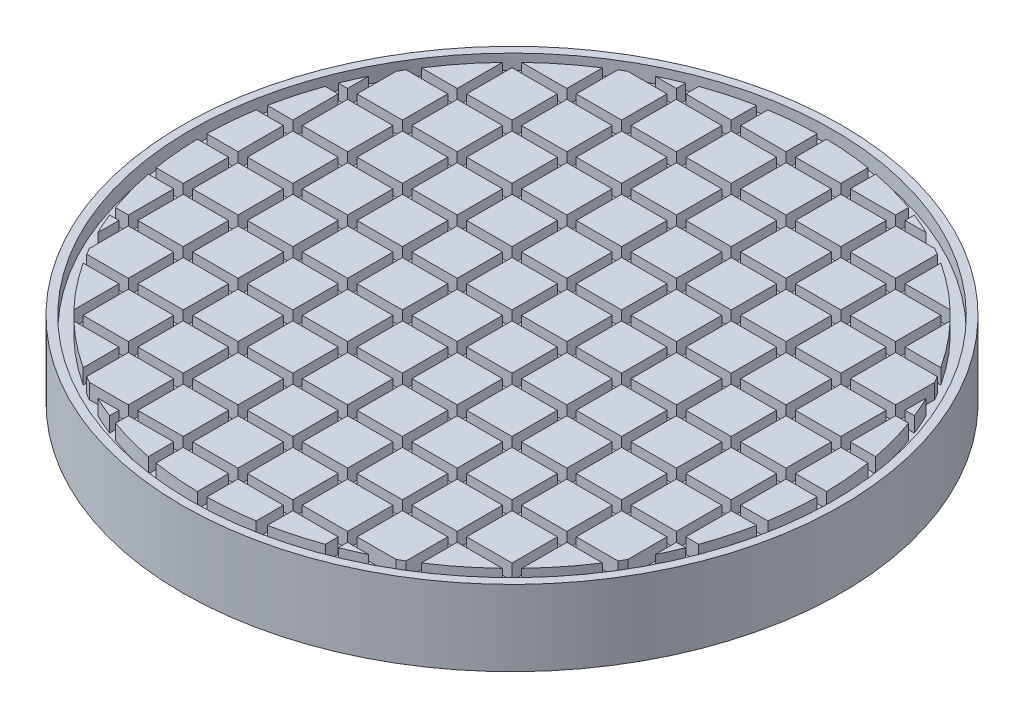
from build123d import *

# Parameters (mm, degrees)
SKETCH2_R               = 82
BOSS_EXTRUDE1_DEPTH     = 20
SKETCH3_W               = 164
SKETCH3_H               = 2.5
SKETCH3_W_2             = 2.5
SKETCH3_H_2             = 164
CUT_EXTRUDE_THIN1_DEPTH = 4
SKETCH7_R               = 87.2
SKETCH7_R_2             = 82
BOSS_EXTRUDE4_DEPTH     = 20
CUT_EXTRUDE2_START      = -4
SKETCH9_R               = 85
SKETCH9_R_2             = 82
CUT_EXTRUDE2_DEPTH      = 4


with BuildPart() as part:
    # Sketch2 → Boss-Extrude1 (new body)
    with BuildSketch(Plane(origin=(0, 0, 0), x_dir=(1, 0, 0), z_dir=(0, 1, 0))):
        with Locations(Location((0, 0, 0), (0, 0, 270))):
            Circle(SKETCH2_R)
    extrude(amount=BOSS_EXTRUDE1_DEPTH)

    # Sketch3 → Cut-Extrude-Thin1 (cut)
    with BuildSketch(Plane(origin=(0, 20, 0), x_dir=(1, 0, 0), z_dir=(0, 1, 0))):
        Rectangle(SKETCH3_W, SKETCH3_H)
        Rectangle(SKETCH3_W_2, SKETCH3_H_2)
        with Locations((0, 14.5)):
            Rectangle(SKETCH3_W, SKETCH3_H)
        with Locations((0, 29)):
            Rectangle(SKETCH3_W, SKETCH3_H)
        with Locations((0, 43.5)):
            Rectangle(SKETCH3_W, SKETCH3_H)
        with Locations((0, 58)):
            Rectangle(SKETCH3_W, SKETCH3_H)
        with Locations((0, 72.5)):
            Rectangle(SKETCH3_W, SKETCH3_H)
        with Locations((0, 87)):
            Rectangle(SKETCH3_W, SKETCH3_H)
        with Locations((0, 101.5)):
            Rectangle(SKETCH3_W, SKETCH3_H)
        with Locations((0, -14.5)):
            Rectangle(SKETCH3_W, SKETCH3_H)
        with Locations((0, -29)):
            Rectangle(SKETCH3_W, SKETCH3_H)
        with Locations((0, -43.5)):
            Rectangle(SKETCH3_W, SKETCH3_H)
        with Locations((0, -58)):
            Rectangle(SKETCH3_W, SKETCH3_H)
        with Locations((0, -72.5)):
            Rectangle(SKETCH3_W, SKETCH3_H)
        with Locations((0, -87)):
            Rectangle(SKETCH3_W, SKETCH3_H)
        with Locations((0, -101.5)):
            Rectangle(SKETCH3_W, SKETCH3_H)
        with Locations((14.5, 0)):
            Rectangle(SKETCH3_W_2, SKETCH3_H_2)
        with Locations((29, 0)):
            Rectangle(SKETCH3_W_2, SKETCH3_H_2)
        with Locations((43.5, 0)):
            Rectangle(SKETCH3_W_2, SKETCH3_H_2)
        with Locations((58, 0)):
            Rectangle(SKETCH3_W_2, SKETCH3_H_2)
        with Locations((72.5, 0)):
            Rectangle(SKETCH3_W_2, SKETCH3_H_2)
        with Locations((87, 0)):
            Rectangle(SKETCH3_W_2, SKETCH3_H_2)
        with Locations((101.5, 0)):
            Rectangle(SKETCH3_W_2, SKETCH3_H_2)
        with Locations((-14.5, 0)):
            Rectangle(SKETCH3_W_2, SKETCH3_H_2)
        with Locations((-29, 0)):
            Rectangle(SKETCH3_W_2, SKETCH3_H_2)
        with Locations((-43.5, 0)):
            Rectangle(SKETCH3_W_2, SKETCH3_H_2)
        with Locations((-58, 0)):
            Rectangle(SKETCH3_W_2, SKETCH3_H_2)
        with Locations((-72.5, 0)):
            Rectangle(SKETCH3_W_2, SKETCH3_H_2)
        with Locations((-87, 0)):
            Rectangle(SKETCH3_W_2, SKETCH3_H_2)
        with Locations((-101.5, 0)):
            Rectangle(SKETCH3_W_2, SKETCH3_H_2)
    extrude(amount=-CUT_EXTRUDE_THIN1_DEPTH, mode=Mode.SUBTRACT)

    # Sketch7 → Boss-Extrude4 (add)
    with BuildSketch(Plane.XZ):
        with Locations(Location((0, 0, 0), (0, 0, 270))):
            Circle(SKETCH7_R)
        Circle(SKETCH7_R_2, mode=Mode.SUBTRACT)
    extrude(amount=-BOSS_EXTRUDE4_DEPTH)

    # Sketch9 → Cut-Extrude2 (cut)
    with BuildSketch(Plane(origin=(0, 20, 0), x_dir=(1, 0, 0), z_dir=(0, 1, 0)).offset(CUT_EXTRUDE2_START)):
        with Locations(Location((0, 0, 0), (0, 0, 270))):
            Circle(SKETCH9_R)
        Circle(SKETCH9_R_2, mode=Mode.SUBTRACT)
    extrude(amount=CUT_EXTRUDE2_DEPTH, mode=Mode.SUBTRACT)


solid = part.part
